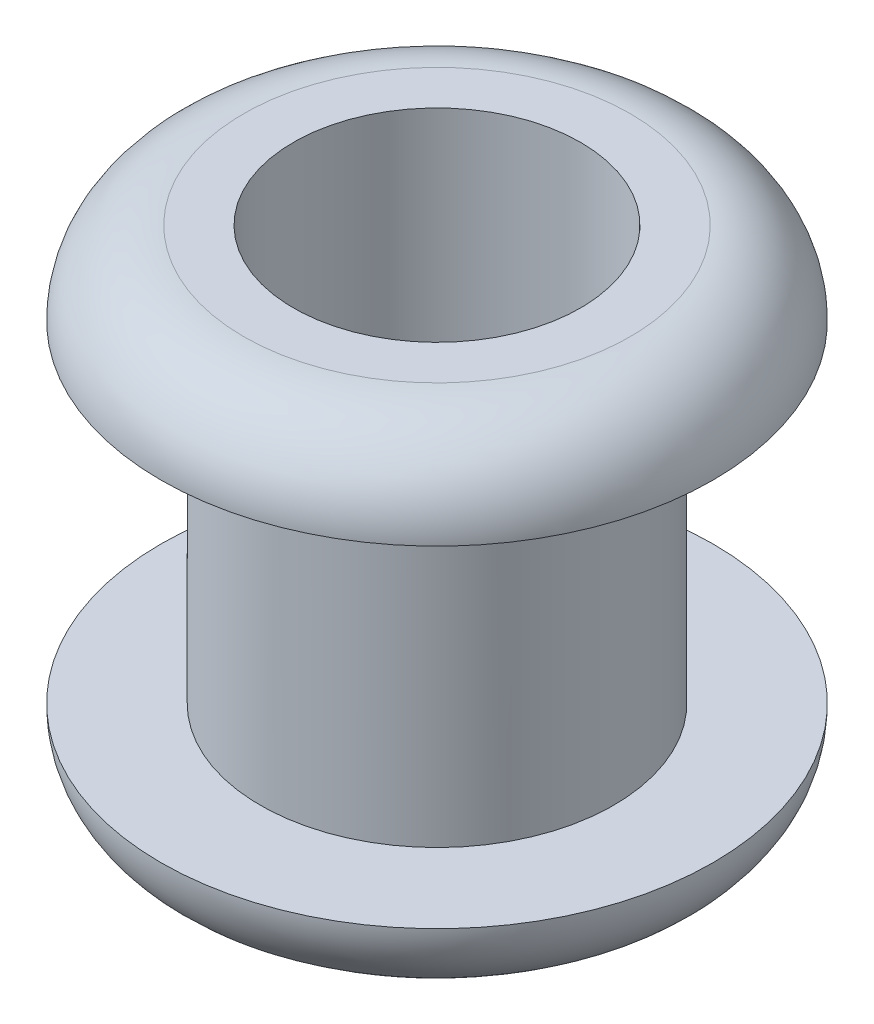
ISO-10303-21;
HEADER;
FILE_DESCRIPTION(('STEP AP214'),'2;1');
FILE_NAME('part.step','',(''),(''),'','','');
FILE_SCHEMA(('AUTOMOTIVE_DESIGN { 1 0 10303 214 1 1 1 1 }'));
ENDSEC;
DATA;
#1=APPLICATION_CONTEXT('core data for automotive mechanical design processes');
#2=APPLICATION_PROTOCOL_DEFINITION('international standard','automotive_design',2000,#1);
#3=PRODUCT_CONTEXT('',#1,'mechanical');
#4=PRODUCT('Part','Part','',(#3));
#5=PRODUCT_RELATED_PRODUCT_CATEGORY('part','',(#4));
#6=PRODUCT_DEFINITION_FORMATION('','',#4);
#7=PRODUCT_DEFINITION_CONTEXT('part definition',#1,'design');
#8=PRODUCT_DEFINITION('design','',#6,#7);
#9=PRODUCT_DEFINITION_SHAPE('','',#8);
#10=(LENGTH_UNIT() NAMED_UNIT(*) SI_UNIT(.MILLI.,.METRE.));
#11=(NAMED_UNIT(*) PLANE_ANGLE_UNIT() SI_UNIT($,.RADIAN.));
#12=(NAMED_UNIT(*) SI_UNIT($,.STERADIAN.) SOLID_ANGLE_UNIT());
#13=UNCERTAINTY_MEASURE_WITH_UNIT(LENGTH_MEASURE(1.E-05),#10,'distance_accuracy_value','');
#14=(GEOMETRIC_REPRESENTATION_CONTEXT(3) GLOBAL_UNCERTAINTY_ASSIGNED_CONTEXT((#13)) GLOBAL_UNIT_ASSIGNED_CONTEXT((#10,
#11,#12)) REPRESENTATION_CONTEXT('',''));
#15=CARTESIAN_POINT('',(0.,0.,0.));
#16=DIRECTION('',(0.,0.,1.));
#17=DIRECTION('',(1.,0.,0.));
#18=AXIS2_PLACEMENT_3D('',#15,#16,#17);
#19=CARTESIAN_POINT('',(0.,3.,0.));
#20=DIRECTION('',(0.,-1.,0.));
#21=DIRECTION('',(0.,0.,-1.));
#22=AXIS2_PLACEMENT_3D('',#19,#20,#21);
#23=CYLINDRICAL_SURFACE('',#22,1.6);
#24=CARTESIAN_POINT('',(0.,3.,0.));
#25=DIRECTION('',(0.,1.,0.));
#26=DIRECTION('',(0.,0.,1.));
#27=AXIS2_PLACEMENT_3D('',#24,#25,#26);
#28=CIRCLE('',#27,1.6);
#29=CARTESIAN_POINT('',(0.,3.,1.6));
#30=VERTEX_POINT('',#29);
#31=EDGE_CURVE('E38',#30,#30,#28,.T.);
#32=ORIENTED_EDGE('',*,*,#31,.F.);
#33=EDGE_LOOP('',(#32));
#34=FACE_BOUND('',#33,.T.);
#35=CARTESIAN_POINT('',(0.,0.,0.));
#36=DIRECTION('',(0.,-1.,0.));
#37=DIRECTION('',(0.,0.,-1.));
#38=AXIS2_PLACEMENT_3D('',#35,#36,#37);
#39=CIRCLE('',#38,1.6);
#40=CARTESIAN_POINT('',(0.,0.,-1.6));
#41=VERTEX_POINT('',#40);
#42=EDGE_CURVE('E47',#41,#41,#39,.T.);
#43=ORIENTED_EDGE('',*,*,#42,.F.);
#44=EDGE_LOOP('',(#43));
#45=FACE_BOUND('',#44,.T.);
#46=ADVANCED_FACE('F28',(#34,#45),#23,.T.);
#47=CARTESIAN_POINT('',(0.,3.,0.));
#48=DIRECTION('',(0.,1.,0.));
#49=DIRECTION('',(0.,0.,1.));
#50=AXIS2_PLACEMENT_3D('',#47,#48,#49);
#51=PLANE('',#50);
#52=CARTESIAN_POINT('',(0.,3.,0.));
#53=DIRECTION('',(0.,1.,0.));
#54=DIRECTION('',(0.,0.,1.));
#55=AXIS2_PLACEMENT_3D('',#52,#53,#54);
#56=CIRCLE('',#55,2.5);
#57=CARTESIAN_POINT('',(0.,3.,2.5));
#58=VERTEX_POINT('',#57);
#59=EDGE_CURVE('E42',#58,#58,#56,.T.);
#60=ORIENTED_EDGE('',*,*,#59,.F.);
#61=EDGE_LOOP('',(#60));
#62=FACE_BOUND('',#61,.T.);
#63=ORIENTED_EDGE('',*,*,#31,.T.);
#64=EDGE_LOOP('',(#63));
#65=FACE_BOUND('',#64,.T.);
#66=ADVANCED_FACE('F77',(#62,#65),#51,.F.);
#67=CARTESIAN_POINT('',(0.,3.75,0.));
#68=DIRECTION('',(0.,1.,0.));
#69=DIRECTION('',(0.,0.,1.));
#70=AXIS2_PLACEMENT_3D('',#67,#68,#69);
#71=PLANE('',#70);
#72=CARTESIAN_POINT('',(0.,3.75,0.));
#73=DIRECTION('',(0.,1.,0.));
#74=DIRECTION('',(0.,0.,1.));
#75=AXIS2_PLACEMENT_3D('',#72,#73,#74);
#76=CIRCLE('',#75,1.75);
#77=CARTESIAN_POINT('',(0.,3.75,1.75));
#78=VERTEX_POINT('',#77);
#79=EDGE_CURVE('E10',#78,#78,#76,.T.);
#80=ORIENTED_EDGE('',*,*,#79,.T.);
#81=EDGE_LOOP('',(#80));
#82=FACE_BOUND('',#81,.T.);
#83=CARTESIAN_POINT('',(0.,3.75,0.));
#84=DIRECTION('',(0.,-1.,0.));
#85=DIRECTION('',(0.,0.,-1.));
#86=AXIS2_PLACEMENT_3D('',#83,#84,#85);
#87=CIRCLE('',#86,1.3);
#88=CARTESIAN_POINT('',(0.,3.75,-1.3));
#89=VERTEX_POINT('',#88);
#90=EDGE_CURVE('E53',#89,#89,#87,.T.);
#91=ORIENTED_EDGE('',*,*,#90,.T.);
#92=EDGE_LOOP('',(#91));
#93=FACE_BOUND('',#92,.T.);
#94=ADVANCED_FACE('F72',(#82,#93),#71,.T.);
#95=CARTESIAN_POINT('',(0.,0.,0.));
#96=DIRECTION('',(0.,-1.,0.));
#97=DIRECTION('',(0.,0.,-1.));
#98=AXIS2_PLACEMENT_3D('',#95,#96,#97);
#99=PLANE('',#98);
#100=CARTESIAN_POINT('',(0.,0.,0.));
#101=DIRECTION('',(0.,-1.,0.));
#102=DIRECTION('',(0.,0.,-1.));
#103=AXIS2_PLACEMENT_3D('',#100,#101,#102);
#104=CIRCLE('',#103,2.5);
#105=CARTESIAN_POINT('',(0.,0.,-2.5));
#106=VERTEX_POINT('',#105);
#107=EDGE_CURVE('E50',#106,#106,#104,.T.);
#108=ORIENTED_EDGE('',*,*,#107,.F.);
#109=EDGE_LOOP('',(#108));
#110=FACE_BOUND('',#109,.T.);
#111=ORIENTED_EDGE('',*,*,#42,.T.);
#112=EDGE_LOOP('',(#111));
#113=FACE_BOUND('',#112,.T.);
#114=ADVANCED_FACE('F64',(#110,#113),#99,.F.);
#115=CARTESIAN_POINT('',(0.,-0.75,0.));
#116=DIRECTION('',(0.,-1.,0.));
#117=DIRECTION('',(0.,0.,-1.));
#118=AXIS2_PLACEMENT_3D('',#115,#116,#117);
#119=PLANE('',#118);
#120=CARTESIAN_POINT('',(0.,-0.75,0.));
#121=DIRECTION('',(0.,-1.,0.));
#122=DIRECTION('',(0.,0.,-1.));
#123=AXIS2_PLACEMENT_3D('',#120,#121,#122);
#124=CIRCLE('',#123,1.75);
#125=CARTESIAN_POINT('',(0.,-0.75,-1.75));
#126=VERTEX_POINT('',#125);
#127=EDGE_CURVE('E34',#126,#126,#124,.T.);
#128=ORIENTED_EDGE('',*,*,#127,.T.);
#129=EDGE_LOOP('',(#128));
#130=FACE_BOUND('',#129,.T.);
#131=CARTESIAN_POINT('',(0.,-0.75,0.));
#132=DIRECTION('',(0.,-1.,0.));
#133=DIRECTION('',(0.,0.,-1.));
#134=AXIS2_PLACEMENT_3D('',#131,#132,#133);
#135=CIRCLE('',#134,1.3);
#136=CARTESIAN_POINT('',(0.,-0.75,-1.3));
#137=VERTEX_POINT('',#136);
#138=EDGE_CURVE('E56',#137,#137,#135,.T.);
#139=ORIENTED_EDGE('',*,*,#138,.F.);
#140=EDGE_LOOP('',(#139));
#141=FACE_BOUND('',#140,.T.);
#142=ADVANCED_FACE('F62',(#130,#141),#119,.T.);
#143=CARTESIAN_POINT('',(0.,3.,0.));
#144=DIRECTION('',(0.,-1.,0.));
#145=DIRECTION('',(0.,0.,-1.));
#146=AXIS2_PLACEMENT_3D('',#143,#144,#145);
#147=CYLINDRICAL_SURFACE('',#146,1.3);
#148=ORIENTED_EDGE('',*,*,#90,.F.);
#149=EDGE_LOOP('',(#148));
#150=FACE_BOUND('',#149,.T.);
#151=ORIENTED_EDGE('',*,*,#138,.T.);
#152=EDGE_LOOP('',(#151));
#153=FACE_BOUND('',#152,.T.);
#154=ADVANCED_FACE('F60',(#150,#153),#147,.F.);
#155=CARTESIAN_POINT('',(0.,0.,0.));
#156=DIRECTION('',(0.,-1.,0.));
#157=DIRECTION('',(0.,0.,-1.));
#158=AXIS2_PLACEMENT_3D('',#155,#156,#157);
#159=TOROIDAL_SURFACE('',#158,1.75,0.75);
#160=ORIENTED_EDGE('',*,*,#107,.T.);
#161=EDGE_LOOP('',(#160));
#162=FACE_BOUND('',#161,.T.);
#163=ORIENTED_EDGE('',*,*,#127,.F.);
#164=EDGE_LOOP('',(#163));
#165=FACE_BOUND('',#164,.T.);
#166=ADVANCED_FACE('F70',(#162,#165),#159,.T.);
#167=CARTESIAN_POINT('',(0.,3.,0.));
#168=DIRECTION('',(0.,1.,0.));
#169=DIRECTION('',(0.,0.,1.));
#170=AXIS2_PLACEMENT_3D('',#167,#168,#169);
#171=TOROIDAL_SURFACE('',#170,1.75,0.75);
#172=ORIENTED_EDGE('',*,*,#59,.T.);
#173=EDGE_LOOP('',(#172));
#174=FACE_BOUND('',#173,.T.);
#175=ORIENTED_EDGE('',*,*,#79,.F.);
#176=EDGE_LOOP('',(#175));
#177=FACE_BOUND('',#176,.T.);
#178=ADVANCED_FACE('F94',(#174,#177),#171,.T.);
#179=CLOSED_SHELL('',(#46,#66,#94,#114,#142,#154,#166,#178));
#180=MANIFOLD_SOLID_BREP('B2',#179);
#181=ADVANCED_BREP_SHAPE_REPRESENTATION('',(#18,#180),#14);
#182=SHAPE_DEFINITION_REPRESENTATION(#9,#181);
ENDSEC;
END-ISO-10303-21;
